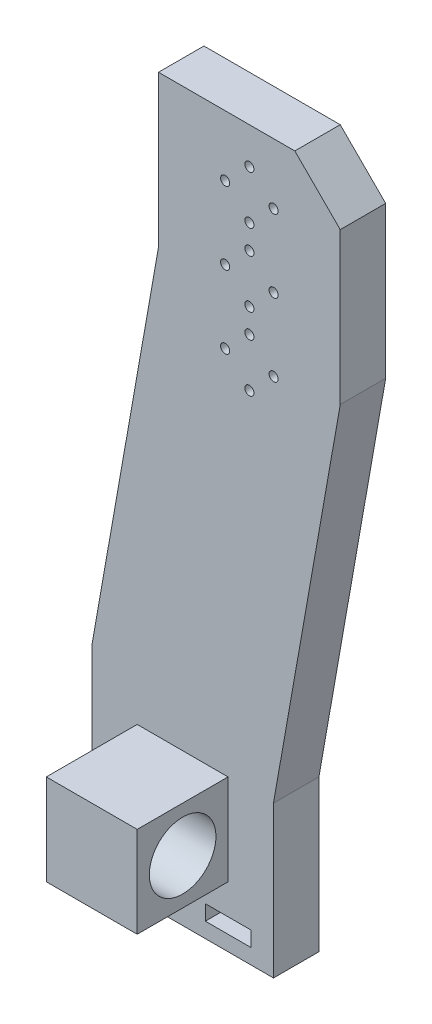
from build123d import *

# Parameters (mm, degrees)
CROQUIS1_R              = 1.5
CROQUIS1_W              = 15
CROQUIS1_H              = 5
SALIENTE_EXTRUIR1_DEPTH = 15
CROQUIS4_W              = 30
CROQUIS4_H              = 30
SALIENTE_EXTRUIR3_DEPTH = 30
CROQUIS5_R              = 11
CORTAR_EXTRUIR2_DEPTH   = 60


with BuildPart() as part:
    # Croquis1 → Saliente-Extruir1 (new body)
    with BuildSketch(Plane.XY):
        Polygon((0, 0), (60, 0), (60, 50), (82.040872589, 175), (82.040872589, 225), (67.040872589, 240), (22.040872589, 240), (22.040872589, 190), (0, 65), align=None)
        with Locations((44.040872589, 220)):
            Circle(CROQUIS1_R, mode=Mode.SUBTRACT)
        with Locations((52.040872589, 228)):
            Circle(CROQUIS1_R, mode=Mode.SUBTRACT)
        with Locations((60.040872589, 220)):
            Circle(CROQUIS1_R, mode=Mode.SUBTRACT)
        with Locations((52.040872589, 212)):
            Circle(CROQUIS1_R, mode=Mode.SUBTRACT)
        with Locations(Location((52.040872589, 204, 0), (0, 0, 180))):
            Circle(CROQUIS1_R, mode=Mode.SUBTRACT)
        with Locations(Location((60.040872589, 196, 0), (0, 0, 180))):
            Circle(CROQUIS1_R, mode=Mode.SUBTRACT)
        with Locations(Location((52.040872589, 188, 0), (0, 0, 180))):
            Circle(CROQUIS1_R, mode=Mode.SUBTRACT)
        with Locations(Location((44.040872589, 196, 0), (0, 0, 180))):
            Circle(CROQUIS1_R, mode=Mode.SUBTRACT)
        with Locations((52.040872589, 180)):
            Circle(CROQUIS1_R, mode=Mode.SUBTRACT)
        with Locations((60.040872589, 172)):
            Circle(CROQUIS1_R, mode=Mode.SUBTRACT)
        with Locations((52.040872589, 164)):
            Circle(CROQUIS1_R, mode=Mode.SUBTRACT)
        with Locations((44.040872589, 172)):
            Circle(CROQUIS1_R, mode=Mode.SUBTRACT)
        with Locations((15, 7.5)):
            Rectangle(CROQUIS1_W, CROQUIS1_H, mode=Mode.SUBTRACT)
        with Locations((45, 7.5)):
            Rectangle(CROQUIS1_W, CROQUIS1_H, mode=Mode.SUBTRACT)
    extrude(amount=SALIENTE_EXTRUIR1_DEPTH)

    # Croquis4 → Saliente-Extruir3 (add)
    with BuildSketch(Plane.XY.offset(15)):
        with Locations((30, 35)):
            Rectangle(CROQUIS4_W, CROQUIS4_H)
    extrude(amount=SALIENTE_EXTRUIR3_DEPTH)

    # Croquis5 → Cortar-Extruir2 (cut)
    with BuildSketch(Plane.ZY.offset(-15)):
        with Locations(Location((30, 35, 0), (0, 0, 270))):
            Circle(CROQUIS5_R)
    extrude(amount=-CORTAR_EXTRUIR2_DEPTH, mode=Mode.SUBTRACT)


solid = part.part
